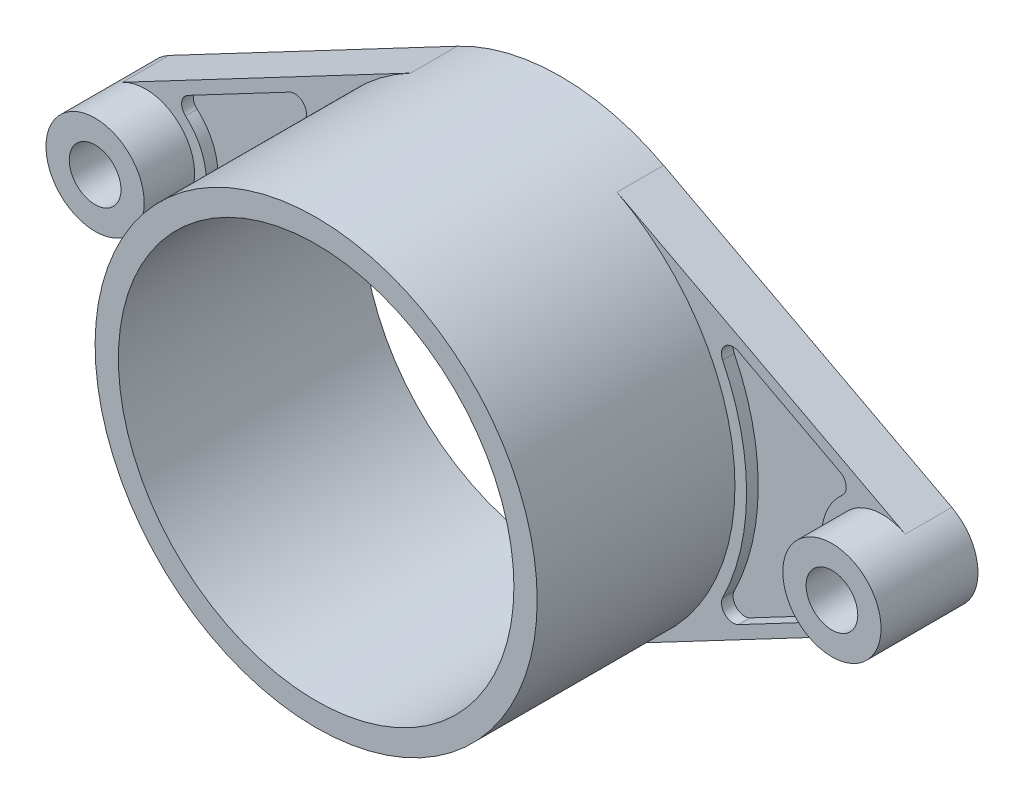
ISO-10303-21;
HEADER;
FILE_DESCRIPTION(('STEP AP214'),'2;1');
FILE_NAME('part.step','',(''),(''),'','','');
FILE_SCHEMA(('AUTOMOTIVE_DESIGN { 1 0 10303 214 1 1 1 1 }'));
ENDSEC;
DATA;
#1=APPLICATION_CONTEXT('core data for automotive mechanical design processes');
#2=APPLICATION_PROTOCOL_DEFINITION('international standard','automotive_design',2000,#1);
#3=PRODUCT_CONTEXT('',#1,'mechanical');
#4=PRODUCT('Part','Part','',(#3));
#5=PRODUCT_RELATED_PRODUCT_CATEGORY('part','',(#4));
#6=PRODUCT_DEFINITION_FORMATION('','',#4);
#7=PRODUCT_DEFINITION_CONTEXT('part definition',#1,'design');
#8=PRODUCT_DEFINITION('design','',#6,#7);
#9=PRODUCT_DEFINITION_SHAPE('','',#8);
#10=(LENGTH_UNIT() NAMED_UNIT(*) SI_UNIT(.MILLI.,.METRE.));
#11=(NAMED_UNIT(*) PLANE_ANGLE_UNIT() SI_UNIT($,.RADIAN.));
#12=(NAMED_UNIT(*) SI_UNIT($,.STERADIAN.) SOLID_ANGLE_UNIT());
#13=UNCERTAINTY_MEASURE_WITH_UNIT(LENGTH_MEASURE(1.E-05),#10,'distance_accuracy_value','');
#14=(GEOMETRIC_REPRESENTATION_CONTEXT(3) GLOBAL_UNCERTAINTY_ASSIGNED_CONTEXT((#13)) GLOBAL_UNIT_ASSIGNED_CONTEXT((#10,
#11,#12)) REPRESENTATION_CONTEXT('',''));
#15=CARTESIAN_POINT('',(0.,0.,0.));
#16=DIRECTION('',(0.,0.,1.));
#17=DIRECTION('',(1.,0.,0.));
#18=AXIS2_PLACEMENT_3D('',#15,#16,#17);
#19=CARTESIAN_POINT('',(95.,0.,6.));
#20=DIRECTION('',(0.,0.,1.));
#21=DIRECTION('',(1.,0.,0.));
#22=AXIS2_PLACEMENT_3D('',#19,#20,#21);
#23=PLANE('',#22);
#24=DIRECTION('',(-0.884433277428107,0.466666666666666,0.));
#25=VECTOR('',#24,1.);
#26=CARTESIAN_POINT('',(26.6,50.4126968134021,6.));
#27=LINE('',#26,#25);
#28=CARTESIAN_POINT('',(100.911111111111,11.2028215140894,6.));
#29=VERTEX_POINT('',#28);
#30=CARTESIAN_POINT('',(26.6,50.4126968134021,6.));
#31=VERTEX_POINT('',#30);
#32=EDGE_CURVE('E433',#29,#31,#27,.T.);
#33=ORIENTED_EDGE('',*,*,#32,.T.);
#34=CARTESIAN_POINT('',(0.,0.,6.));
#35=DIRECTION('',(0.,0.,1.));
#36=DIRECTION('',(1.,0.,0.));
#37=AXIS2_PLACEMENT_3D('',#34,#35,#36);
#38=CIRCLE('',#37,57.);
#39=CARTESIAN_POINT('',(26.6,-50.4126968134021,6.));
#40=VERTEX_POINT('',#39);
#41=EDGE_CURVE('E387',#40,#31,#38,.T.);
#42=ORIENTED_EDGE('',*,*,#41,.F.);
#43=DIRECTION('',(0.884433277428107,0.466666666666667,0.));
#44=VECTOR('',#43,1.);
#45=CARTESIAN_POINT('',(26.6,-50.4126968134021,6.));
#46=LINE('',#45,#44);
#47=CARTESIAN_POINT('',(100.911111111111,-11.2028215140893,6.));
#48=VERTEX_POINT('',#47);
#49=EDGE_CURVE('E443',#40,#48,#46,.T.);
#50=ORIENTED_EDGE('',*,*,#49,.T.);
#51=CARTESIAN_POINT('',(95.,0.,6.));
#52=DIRECTION('',(0.,0.,1.));
#53=DIRECTION('',(1.,0.,0.));
#54=AXIS2_PLACEMENT_3D('',#51,#52,#53);
#55=CIRCLE('',#54,12.6666666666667);
#56=EDGE_CURVE('E412',#29,#48,#55,.T.);
#57=ORIENTED_EDGE('',*,*,#56,.F.);
#58=EDGE_LOOP('',(#33,#42,#50,#57));
#59=FACE_BOUND('',#58,.T.);
#60=DIRECTION('',(-0.884433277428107,0.466666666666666,0.));
#61=VECTOR('',#60,1.);
#62=CARTESIAN_POINT('',(84.0904899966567,16.686133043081,6.));
#63=LINE('',#62,#61);
#64=CARTESIAN_POINT('',(84.0904899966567,16.686133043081,6.));
#65=VERTEX_POINT('',#64);
#66=CARTESIAN_POINT('',(57.9120772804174,30.4990377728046,6.));
#67=VERTEX_POINT('',#66);
#68=EDGE_CURVE('E69',#65,#67,#63,.T.);
#69=ORIENTED_EDGE('',*,*,#68,.F.);
#70=CARTESIAN_POINT('',(82.6904899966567,14.0328332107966,6.));
#71=DIRECTION('',(0.,0.,1.));
#72=DIRECTION('',(1.,0.,0.));
#73=AXIS2_PLACEMENT_3D('',#70,#71,#72);
#74=CIRCLE('',#73,3.00000000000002);
#75=CARTESIAN_POINT('',(84.6688041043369,11.7775564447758,6.));
#76=VERTEX_POINT('',#75);
#77=EDGE_CURVE('E326',#76,#65,#74,.T.);
#78=ORIENTED_EDGE('',*,*,#77,.F.);
#79=CARTESIAN_POINT('',(95.,0.,6.));
#80=DIRECTION('',(0.,0.,1.));
#81=DIRECTION('',(1.,0.,0.));
#82=AXIS2_PLACEMENT_3D('',#79,#80,#81);
#83=CIRCLE('',#82,15.6666666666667);
#84=CARTESIAN_POINT('',(84.6688041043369,-11.7775564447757,6.));
#85=VERTEX_POINT('',#84);
#86=EDGE_CURVE('E330',#76,#85,#83,.T.);
#87=ORIENTED_EDGE('',*,*,#86,.T.);
#88=CARTESIAN_POINT('',(82.6904899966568,-14.0328332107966,6.));
#89=DIRECTION('',(0.,0.,1.));
#90=DIRECTION('',(1.,0.,0.));
#91=AXIS2_PLACEMENT_3D('',#88,#89,#90);
#92=CIRCLE('',#91,3.);
#93=CARTESIAN_POINT('',(84.0904899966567,-16.6861330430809,6.));
#94=VERTEX_POINT('',#93);
#95=EDGE_CURVE('E335',#94,#85,#92,.T.);
#96=ORIENTED_EDGE('',*,*,#95,.F.);
#97=DIRECTION('',(0.884433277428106,0.466666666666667,0.));
#98=VECTOR('',#97,1.);
#99=CARTESIAN_POINT('',(57.9120772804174,-30.4990377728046,6.));
#100=LINE('',#99,#98);
#101=CARTESIAN_POINT('',(57.9120772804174,-30.4990377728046,6.));
#102=VERTEX_POINT('',#101);
#103=EDGE_CURVE('E339',#102,#94,#100,.T.);
#104=ORIENTED_EDGE('',*,*,#103,.F.);
#105=CARTESIAN_POINT('',(56.5120772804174,-27.8457379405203,6.));
#106=DIRECTION('',(0.,0.,1.));
#107=DIRECTION('',(1.,0.,0.));
#108=AXIS2_PLACEMENT_3D('',#105,#106,#107);
#109=CIRCLE('',#108,3.);
#110=CARTESIAN_POINT('',(53.8210259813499,-26.5197504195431,6.));
#111=VERTEX_POINT('',#110);
#112=EDGE_CURVE('E343',#111,#102,#109,.T.);
#113=ORIENTED_EDGE('',*,*,#112,.F.);
#114=CARTESIAN_POINT('',(0.,0.,6.));
#115=DIRECTION('',(0.,0.,1.));
#116=DIRECTION('',(1.,0.,0.));
#117=AXIS2_PLACEMENT_3D('',#114,#115,#116);
#118=CIRCLE('',#117,60.);
#119=CARTESIAN_POINT('',(53.8210259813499,26.5197504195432,6.));
#120=VERTEX_POINT('',#119);
#121=EDGE_CURVE('E347',#111,#120,#118,.T.);
#122=ORIENTED_EDGE('',*,*,#121,.T.);
#123=CARTESIAN_POINT('',(56.5120772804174,27.8457379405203,6.));
#124=DIRECTION('',(0.,0.,-1.));
#125=DIRECTION('',(-1.,0.,0.));
#126=AXIS2_PLACEMENT_3D('',#123,#124,#125);
#127=CIRCLE('',#126,2.99999999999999);
#128=EDGE_CURVE('E351',#120,#67,#127,.T.);
#129=ORIENTED_EDGE('',*,*,#128,.T.);
#130=EDGE_LOOP('',(#69,#78,#87,#96,#104,#113,#122,#129));
#131=FACE_BOUND('',#130,.T.);
#132=ADVANCED_FACE('F45',(#59,#131),#23,.T.);
#133=CARTESIAN_POINT('',(-82.6904899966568,-14.0328332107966,6.));
#134=DIRECTION('',(0.,0.,1.));
#135=DIRECTION('',(1.,0.,0.));
#136=AXIS2_PLACEMENT_3D('',#133,#134,#135);
#137=CIRCLE('',#136,2.99999999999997);
#138=CARTESIAN_POINT('',(-84.6688041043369,-11.7775564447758,6.));
#139=VERTEX_POINT('',#138);
#140=CARTESIAN_POINT('',(-84.0904899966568,-16.6861330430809,6.));
#141=VERTEX_POINT('',#140);
#142=EDGE_CURVE('E61',#139,#141,#137,.T.);
#143=ORIENTED_EDGE('',*,*,#142,.F.);
#144=CARTESIAN_POINT('',(-95.,0.,6.));
#145=DIRECTION('',(0.,0.,1.));
#146=DIRECTION('',(1.,0.,0.));
#147=AXIS2_PLACEMENT_3D('',#144,#145,#146);
#148=CIRCLE('',#147,15.6666666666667);
#149=CARTESIAN_POINT('',(-84.6688041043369,11.7775564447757,6.));
#150=VERTEX_POINT('',#149);
#151=EDGE_CURVE('E231',#139,#150,#148,.T.);
#152=ORIENTED_EDGE('',*,*,#151,.T.);
#153=CARTESIAN_POINT('',(-82.6904899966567,14.0328332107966,6.));
#154=DIRECTION('',(0.,0.,1.));
#155=DIRECTION('',(1.,0.,0.));
#156=AXIS2_PLACEMENT_3D('',#153,#154,#155);
#157=CIRCLE('',#156,3.00000000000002);
#158=CARTESIAN_POINT('',(-84.0904899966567,16.686133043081,6.));
#159=VERTEX_POINT('',#158);
#160=EDGE_CURVE('E235',#159,#150,#157,.T.);
#161=ORIENTED_EDGE('',*,*,#160,.F.);
#162=DIRECTION('',(-0.884433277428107,-0.466666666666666,0.));
#163=VECTOR('',#162,1.);
#164=CARTESIAN_POINT('',(-57.9120772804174,30.4990377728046,6.));
#165=LINE('',#164,#163);
#166=CARTESIAN_POINT('',(-57.9120772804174,30.4990377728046,6.));
#167=VERTEX_POINT('',#166);
#168=EDGE_CURVE('E273',#167,#159,#165,.T.);
#169=ORIENTED_EDGE('',*,*,#168,.F.);
#170=CARTESIAN_POINT('',(-56.5120772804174,27.8457379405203,6.));
#171=DIRECTION('',(0.,0.,1.));
#172=DIRECTION('',(1.,0.,0.));
#173=AXIS2_PLACEMENT_3D('',#170,#171,#172);
#174=CIRCLE('',#173,3.);
#175=CARTESIAN_POINT('',(-53.8210259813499,26.5197504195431,6.));
#176=VERTEX_POINT('',#175);
#177=EDGE_CURVE('E269',#176,#167,#174,.T.);
#178=ORIENTED_EDGE('',*,*,#177,.F.);
#179=CARTESIAN_POINT('',(0.,0.,6.));
#180=DIRECTION('',(0.,0.,1.));
#181=DIRECTION('',(1.,0.,0.));
#182=AXIS2_PLACEMENT_3D('',#179,#180,#181);
#183=CIRCLE('',#182,60.);
#184=CARTESIAN_POINT('',(-53.8210259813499,-26.5197504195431,6.));
#185=VERTEX_POINT('',#184);
#186=EDGE_CURVE('E265',#176,#185,#183,.T.);
#187=ORIENTED_EDGE('',*,*,#186,.T.);
#188=CARTESIAN_POINT('',(-56.5120772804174,-27.8457379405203,6.));
#189=DIRECTION('',(0.,0.,1.));
#190=DIRECTION('',(1.,0.,0.));
#191=AXIS2_PLACEMENT_3D('',#188,#189,#190);
#192=CIRCLE('',#191,3.);
#193=CARTESIAN_POINT('',(-57.9120772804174,-30.4990377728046,6.));
#194=VERTEX_POINT('',#193);
#195=EDGE_CURVE('E261',#194,#185,#192,.T.);
#196=ORIENTED_EDGE('',*,*,#195,.F.);
#197=DIRECTION('',(0.884433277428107,-0.466666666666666,0.));
#198=VECTOR('',#197,1.);
#199=CARTESIAN_POINT('',(-84.0904899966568,-16.6861330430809,6.));
#200=LINE('',#199,#198);
#201=EDGE_CURVE('E258',#141,#194,#200,.T.);
#202=ORIENTED_EDGE('',*,*,#201,.F.);
#203=EDGE_LOOP('',(#143,#152,#161,#169,#178,#187,#196,#202));
#204=FACE_BOUND('',#203,.T.);
#205=DIRECTION('',(0.884433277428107,-0.466666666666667,0.));
#206=VECTOR('',#205,1.);
#207=CARTESIAN_POINT('',(-100.911111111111,-11.2028215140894,6.));
#208=LINE('',#207,#206);
#209=CARTESIAN_POINT('',(-100.911111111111,-11.2028215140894,6.));
#210=VERTEX_POINT('',#209);
#211=CARTESIAN_POINT('',(-26.6,-50.4126968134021,6.));
#212=VERTEX_POINT('',#211);
#213=EDGE_CURVE('E440',#210,#212,#208,.T.);
#214=ORIENTED_EDGE('',*,*,#213,.T.);
#215=CARTESIAN_POINT('',(-26.6,50.4126968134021,6.));
#216=VERTEX_POINT('',#215);
#217=EDGE_CURVE('E393',#216,#212,#38,.T.);
#218=ORIENTED_EDGE('',*,*,#217,.F.);
#219=DIRECTION('',(-0.884433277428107,-0.466666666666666,0.));
#220=VECTOR('',#219,1.);
#221=CARTESIAN_POINT('',(-100.911111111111,11.2028215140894,6.));
#222=LINE('',#221,#220);
#223=CARTESIAN_POINT('',(-100.911111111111,11.2028215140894,6.));
#224=VERTEX_POINT('',#223);
#225=EDGE_CURVE('E436',#216,#224,#222,.T.);
#226=ORIENTED_EDGE('',*,*,#225,.T.);
#227=CARTESIAN_POINT('',(-95.,0.,6.));
#228=DIRECTION('',(0.,0.,1.));
#229=DIRECTION('',(1.,0.,0.));
#230=AXIS2_PLACEMENT_3D('',#227,#228,#229);
#231=CIRCLE('',#230,12.6666666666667);
#232=EDGE_CURVE('E397',#210,#224,#231,.T.);
#233=ORIENTED_EDGE('',*,*,#232,.F.);
#234=EDGE_LOOP('',(#214,#218,#226,#233));
#235=FACE_BOUND('',#234,.T.);
#236=ADVANCED_FACE('F521',(#204,#235),#23,.T.);
#237=CARTESIAN_POINT('',(95.,0.,-6.));
#238=DIRECTION('',(0.,0.,1.));
#239=DIRECTION('',(1.,0.,0.));
#240=AXIS2_PLACEMENT_3D('',#237,#238,#239);
#241=PLANE('',#240);
#242=CARTESIAN_POINT('',(95.,0.,-6.));
#243=DIRECTION('',(0.,0.,1.));
#244=DIRECTION('',(1.,0.,0.));
#245=AXIS2_PLACEMENT_3D('',#242,#243,#244);
#246=CIRCLE('',#245,12.6666666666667);
#247=CARTESIAN_POINT('',(100.911111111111,-11.2028215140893,-6.));
#248=VERTEX_POINT('',#247);
#249=CARTESIAN_POINT('',(100.911111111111,11.2028215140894,-6.));
#250=VERTEX_POINT('',#249);
#251=EDGE_CURVE('E432',#248,#250,#246,.T.);
#252=ORIENTED_EDGE('',*,*,#251,.F.);
#253=DIRECTION('',(0.884433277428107,0.466666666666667,0.));
#254=VECTOR('',#253,1.);
#255=CARTESIAN_POINT('',(26.6,-50.4126968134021,-6.));
#256=LINE('',#255,#254);
#257=CARTESIAN_POINT('',(26.6,-50.4126968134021,-6.));
#258=VERTEX_POINT('',#257);
#259=EDGE_CURVE('E437',#258,#248,#256,.T.);
#260=ORIENTED_EDGE('',*,*,#259,.F.);
#261=CARTESIAN_POINT('',(0.,0.,-6.));
#262=DIRECTION('',(0.,0.,1.));
#263=DIRECTION('',(1.,0.,0.));
#264=AXIS2_PLACEMENT_3D('',#261,#262,#263);
#265=CIRCLE('',#264,57.);
#266=CARTESIAN_POINT('',(-26.6,-50.4126968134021,-6.));
#267=VERTEX_POINT('',#266);
#268=EDGE_CURVE('E465',#267,#258,#265,.T.);
#269=ORIENTED_EDGE('',*,*,#268,.F.);
#270=DIRECTION('',(0.884433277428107,-0.466666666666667,0.));
#271=VECTOR('',#270,1.);
#272=CARTESIAN_POINT('',(-100.911111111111,-11.2028215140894,-6.));
#273=LINE('',#272,#271);
#274=CARTESIAN_POINT('',(-100.911111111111,-11.2028215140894,-6.));
#275=VERTEX_POINT('',#274);
#276=EDGE_CURVE('E462',#275,#267,#273,.T.);
#277=ORIENTED_EDGE('',*,*,#276,.F.);
#278=CARTESIAN_POINT('',(-95.,0.,-6.));
#279=DIRECTION('',(0.,0.,1.));
#280=DIRECTION('',(1.,0.,0.));
#281=AXIS2_PLACEMENT_3D('',#278,#279,#280);
#282=CIRCLE('',#281,12.6666666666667);
#283=CARTESIAN_POINT('',(-100.911111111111,11.2028215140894,-6.));
#284=VERTEX_POINT('',#283);
#285=EDGE_CURVE('E459',#284,#275,#282,.T.);
#286=ORIENTED_EDGE('',*,*,#285,.F.);
#287=DIRECTION('',(-0.884433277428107,-0.466666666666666,0.));
#288=VECTOR('',#287,1.);
#289=CARTESIAN_POINT('',(-100.911111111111,11.2028215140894,-6.));
#290=LINE('',#289,#288);
#291=CARTESIAN_POINT('',(-26.6,50.4126968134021,-6.));
#292=VERTEX_POINT('',#291);
#293=EDGE_CURVE('E456',#292,#284,#290,.T.);
#294=ORIENTED_EDGE('',*,*,#293,.F.);
#295=CARTESIAN_POINT('',(0.,0.,-6.));
#296=DIRECTION('',(0.,0.,1.));
#297=DIRECTION('',(1.,0.,0.));
#298=AXIS2_PLACEMENT_3D('',#295,#296,#297);
#299=CIRCLE('',#298,57.);
#300=CARTESIAN_POINT('',(26.6,50.4126968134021,-6.));
#301=VERTEX_POINT('',#300);
#302=EDGE_CURVE('E453',#301,#292,#299,.T.);
#303=ORIENTED_EDGE('',*,*,#302,.F.);
#304=DIRECTION('',(-0.884433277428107,0.466666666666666,0.));
#305=VECTOR('',#304,1.);
#306=CARTESIAN_POINT('',(26.6,50.4126968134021,-6.));
#307=LINE('',#306,#305);
#308=EDGE_CURVE('E450',#250,#301,#307,.T.);
#309=ORIENTED_EDGE('',*,*,#308,.F.);
#310=EDGE_LOOP('',(#252,#260,#269,#277,#286,#294,#303,#309));
#311=FACE_BOUND('',#310,.T.);
#312=CARTESIAN_POINT('',(-95.,0.,-6.));
#313=DIRECTION('',(0.,0.,1.));
#314=DIRECTION('',(1.,0.,0.));
#315=AXIS2_PLACEMENT_3D('',#312,#313,#314);
#316=CIRCLE('',#315,6.66666666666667);
#317=CARTESIAN_POINT('',(-88.3333333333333,0.,-6.));
#318=VERTEX_POINT('',#317);
#319=EDGE_CURVE('E428',#318,#318,#316,.T.);
#320=ORIENTED_EDGE('',*,*,#319,.T.);
#321=EDGE_LOOP('',(#320));
#322=FACE_BOUND('',#321,.T.);
#323=CARTESIAN_POINT('',(95.,0.,-6.));
#324=DIRECTION('',(0.,0.,1.));
#325=DIRECTION('',(1.,0.,0.));
#326=AXIS2_PLACEMENT_3D('',#323,#324,#325);
#327=CIRCLE('',#326,6.66666666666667);
#328=CARTESIAN_POINT('',(101.666666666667,0.,-6.));
#329=VERTEX_POINT('',#328);
#330=EDGE_CURVE('E424',#329,#329,#327,.T.);
#331=ORIENTED_EDGE('',*,*,#330,.T.);
#332=EDGE_LOOP('',(#331));
#333=FACE_BOUND('',#332,.T.);
#334=CARTESIAN_POINT('',(0.,0.,-6.));
#335=DIRECTION('',(0.,0.,1.));
#336=DIRECTION('',(1.,0.,0.));
#337=AXIS2_PLACEMENT_3D('',#334,#335,#336);
#338=CIRCLE('',#337,51.);
#339=CARTESIAN_POINT('',(51.,0.,-6.));
#340=VERTEX_POINT('',#339);
#341=EDGE_CURVE('E417',#340,#340,#338,.T.);
#342=ORIENTED_EDGE('',*,*,#341,.T.);
#343=EDGE_LOOP('',(#342));
#344=FACE_BOUND('',#343,.T.);
#345=ADVANCED_FACE('F507',(#311,#322,#333,#344),#241,.F.);
#346=CARTESIAN_POINT('',(95.,0.,6.));
#347=DIRECTION('',(0.,0.,-1.));
#348=DIRECTION('',(-1.,0.,0.));
#349=AXIS2_PLACEMENT_3D('',#346,#347,#348);
#350=CYLINDRICAL_SURFACE('',#349,12.6666666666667);
#351=ORIENTED_EDGE('',*,*,#251,.T.);
#352=DIRECTION('',(0.,0.,-1.));
#353=VECTOR('',#352,1.);
#354=CARTESIAN_POINT('',(100.911111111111,11.2028215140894,6.));
#355=LINE('',#354,#353);
#356=EDGE_CURVE('E11',#29,#250,#355,.T.);
#357=ORIENTED_EDGE('',*,*,#356,.F.);
#358=ORIENTED_EDGE('',*,*,#56,.T.);
#359=DIRECTION('',(0.,0.,-1.));
#360=VECTOR('',#359,1.);
#361=CARTESIAN_POINT('',(100.911111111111,-11.2028215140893,6.));
#362=LINE('',#361,#360);
#363=EDGE_CURVE('E446',#48,#248,#362,.T.);
#364=ORIENTED_EDGE('',*,*,#363,.T.);
#365=EDGE_LOOP('',(#351,#357,#358,#364));
#366=FACE_BOUND('',#365,.T.);
#367=CARTESIAN_POINT('',(95.,0.,19.));
#368=DIRECTION('',(0.,0.,1.));
#369=DIRECTION('',(1.,0.,0.));
#370=AXIS2_PLACEMENT_3D('',#367,#368,#369);
#371=CIRCLE('',#370,12.6666666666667);
#372=CARTESIAN_POINT('',(107.666666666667,0.,19.));
#373=VERTEX_POINT('',#372);
#374=EDGE_CURVE('E413',#373,#373,#371,.T.);
#375=ORIENTED_EDGE('',*,*,#374,.F.);
#376=EDGE_LOOP('',(#375));
#377=FACE_BOUND('',#376,.T.);
#378=ADVANCED_FACE('F47',(#366,#377),#350,.T.);
#379=CARTESIAN_POINT('',(26.6,50.4126968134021,6.));
#380=DIRECTION('',(-0.466666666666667,-0.884433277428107,0.));
#381=DIRECTION('',(0.884433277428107,-0.466666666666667,0.));
#382=AXIS2_PLACEMENT_3D('',#379,#380,#381);
#383=PLANE('',#382);
#384=ORIENTED_EDGE('',*,*,#308,.T.);
#385=DIRECTION('',(0.,0.,-1.));
#386=VECTOR('',#385,1.);
#387=CARTESIAN_POINT('',(26.6,50.4126968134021,6.));
#388=LINE('',#387,#386);
#389=EDGE_CURVE('E54',#31,#301,#388,.T.);
#390=ORIENTED_EDGE('',*,*,#389,.F.);
#391=ORIENTED_EDGE('',*,*,#32,.F.);
#392=ORIENTED_EDGE('',*,*,#356,.T.);
#393=EDGE_LOOP('',(#384,#390,#391,#392));
#394=FACE_BOUND('',#393,.T.);
#395=ADVANCED_FACE('F536',(#394),#383,.F.);
#396=CARTESIAN_POINT('',(-100.911111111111,11.2028215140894,6.));
#397=DIRECTION('',(0.466666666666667,-0.884433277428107,0.));
#398=DIRECTION('',(0.884433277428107,0.466666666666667,0.));
#399=AXIS2_PLACEMENT_3D('',#396,#397,#398);
#400=PLANE('',#399);
#401=ORIENTED_EDGE('',*,*,#293,.T.);
#402=DIRECTION('',(0.,0.,-1.));
#403=VECTOR('',#402,1.);
#404=CARTESIAN_POINT('',(-100.911111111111,11.2028215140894,6.));
#405=LINE('',#404,#403);
#406=EDGE_CURVE('E485',#224,#284,#405,.T.);
#407=ORIENTED_EDGE('',*,*,#406,.F.);
#408=ORIENTED_EDGE('',*,*,#225,.F.);
#409=DIRECTION('',(0.,0.,-1.));
#410=VECTOR('',#409,1.);
#411=CARTESIAN_POINT('',(-26.6,50.4126968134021,6.));
#412=LINE('',#411,#410);
#413=EDGE_CURVE('E489',#216,#292,#412,.T.);
#414=ORIENTED_EDGE('',*,*,#413,.T.);
#415=EDGE_LOOP('',(#401,#407,#408,#414));
#416=FACE_BOUND('',#415,.T.);
#417=ADVANCED_FACE('F513',(#416),#400,.F.);
#418=CARTESIAN_POINT('',(-95.,0.,6.));
#419=DIRECTION('',(0.,0.,-1.));
#420=DIRECTION('',(-1.,0.,0.));
#421=AXIS2_PLACEMENT_3D('',#418,#419,#420);
#422=CYLINDRICAL_SURFACE('',#421,12.6666666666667);
#423=ORIENTED_EDGE('',*,*,#285,.T.);
#424=DIRECTION('',(0.,0.,-1.));
#425=VECTOR('',#424,1.);
#426=CARTESIAN_POINT('',(-100.911111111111,-11.2028215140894,6.));
#427=LINE('',#426,#425);
#428=EDGE_CURVE('E481',#210,#275,#427,.T.);
#429=ORIENTED_EDGE('',*,*,#428,.F.);
#430=ORIENTED_EDGE('',*,*,#232,.T.);
#431=ORIENTED_EDGE('',*,*,#406,.T.);
#432=EDGE_LOOP('',(#423,#429,#430,#431));
#433=FACE_BOUND('',#432,.T.);
#434=CARTESIAN_POINT('',(-95.,0.,19.));
#435=DIRECTION('',(0.,0.,1.));
#436=DIRECTION('',(1.,0.,0.));
#437=AXIS2_PLACEMENT_3D('',#434,#435,#436);
#438=CIRCLE('',#437,12.6666666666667);
#439=CARTESIAN_POINT('',(-82.3333333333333,0.,19.));
#440=VERTEX_POINT('',#439);
#441=EDGE_CURVE('E392',#440,#440,#438,.T.);
#442=ORIENTED_EDGE('',*,*,#441,.F.);
#443=EDGE_LOOP('',(#442));
#444=FACE_BOUND('',#443,.T.);
#445=ADVANCED_FACE('F516',(#433,#444),#422,.T.);
#446=CARTESIAN_POINT('',(-100.911111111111,-11.2028215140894,6.));
#447=DIRECTION('',(0.466666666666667,0.884433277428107,0.));
#448=DIRECTION('',(-0.884433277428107,0.466666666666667,0.));
#449=AXIS2_PLACEMENT_3D('',#446,#447,#448);
#450=PLANE('',#449);
#451=ORIENTED_EDGE('',*,*,#276,.T.);
#452=DIRECTION('',(0.,0.,-1.));
#453=VECTOR('',#452,1.);
#454=CARTESIAN_POINT('',(-26.6,-50.4126968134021,6.));
#455=LINE('',#454,#453);
#456=EDGE_CURVE('E477',#212,#267,#455,.T.);
#457=ORIENTED_EDGE('',*,*,#456,.F.);
#458=ORIENTED_EDGE('',*,*,#213,.F.);
#459=ORIENTED_EDGE('',*,*,#428,.T.);
#460=EDGE_LOOP('',(#451,#457,#458,#459));
#461=FACE_BOUND('',#460,.T.);
#462=ADVANCED_FACE('F561',(#461),#450,.F.);
#463=CARTESIAN_POINT('',(0.,0.,6.));
#464=DIRECTION('',(0.,0.,-1.));
#465=DIRECTION('',(-1.,0.,0.));
#466=AXIS2_PLACEMENT_3D('',#463,#464,#465);
#467=CYLINDRICAL_SURFACE('',#466,57.);
#468=ORIENTED_EDGE('',*,*,#268,.T.);
#469=DIRECTION('',(0.,0.,-1.));
#470=VECTOR('',#469,1.);
#471=CARTESIAN_POINT('',(26.6,-50.4126968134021,6.));
#472=LINE('',#471,#470);
#473=EDGE_CURVE('E473',#40,#258,#472,.T.);
#474=ORIENTED_EDGE('',*,*,#473,.F.);
#475=ORIENTED_EDGE('',*,*,#41,.T.);
#476=ORIENTED_EDGE('',*,*,#389,.T.);
#477=ORIENTED_EDGE('',*,*,#302,.T.);
#478=ORIENTED_EDGE('',*,*,#413,.F.);
#479=ORIENTED_EDGE('',*,*,#217,.T.);
#480=ORIENTED_EDGE('',*,*,#456,.T.);
#481=EDGE_LOOP('',(#468,#474,#475,#476,#477,#478,#479,#480));
#482=FACE_BOUND('',#481,.T.);
#483=CARTESIAN_POINT('',(0.,0.,57.));
#484=DIRECTION('',(0.,0.,1.));
#485=DIRECTION('',(1.,0.,0.));
#486=AXIS2_PLACEMENT_3D('',#483,#484,#485);
#487=CIRCLE('',#486,57.);
#488=CARTESIAN_POINT('',(57.,0.,57.));
#489=VERTEX_POINT('',#488);
#490=EDGE_CURVE('E388',#489,#489,#487,.T.);
#491=ORIENTED_EDGE('',*,*,#490,.F.);
#492=EDGE_LOOP('',(#491));
#493=FACE_BOUND('',#492,.T.);
#494=ADVANCED_FACE('F497',(#482,#493),#467,.T.);
#495=CARTESIAN_POINT('',(26.6,-50.4126968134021,6.));
#496=DIRECTION('',(-0.466666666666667,0.884433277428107,0.));
#497=DIRECTION('',(-0.884433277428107,-0.466666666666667,0.));
#498=AXIS2_PLACEMENT_3D('',#495,#496,#497);
#499=PLANE('',#498);
#500=ORIENTED_EDGE('',*,*,#259,.T.);
#501=ORIENTED_EDGE('',*,*,#363,.F.);
#502=ORIENTED_EDGE('',*,*,#49,.F.);
#503=ORIENTED_EDGE('',*,*,#473,.T.);
#504=EDGE_LOOP('',(#500,#501,#502,#503));
#505=FACE_BOUND('',#504,.T.);
#506=ADVANCED_FACE('F530',(#505),#499,.F.);
#507=CARTESIAN_POINT('',(-95.,0.,6.));
#508=DIRECTION('',(0.,0.,-1.));
#509=DIRECTION('',(-1.,0.,0.));
#510=AXIS2_PLACEMENT_3D('',#507,#508,#509);
#511=CYLINDRICAL_SURFACE('',#510,6.66666666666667);
#512=ORIENTED_EDGE('',*,*,#319,.F.);
#513=EDGE_LOOP('',(#512));
#514=FACE_BOUND('',#513,.T.);
#515=CARTESIAN_POINT('',(-95.,0.,19.));
#516=DIRECTION('',(0.,0.,1.));
#517=DIRECTION('',(1.,0.,0.));
#518=AXIS2_PLACEMENT_3D('',#515,#516,#517);
#519=CIRCLE('',#518,6.66666666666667);
#520=CARTESIAN_POINT('',(-88.3333333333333,0.,19.));
#521=VERTEX_POINT('',#520);
#522=EDGE_CURVE('E401',#521,#521,#519,.T.);
#523=ORIENTED_EDGE('',*,*,#522,.T.);
#524=EDGE_LOOP('',(#523));
#525=FACE_BOUND('',#524,.T.);
#526=ADVANCED_FACE('F553',(#514,#525),#511,.F.);
#527=CARTESIAN_POINT('',(95.,0.,6.));
#528=DIRECTION('',(0.,0.,-1.));
#529=DIRECTION('',(-1.,0.,0.));
#530=AXIS2_PLACEMENT_3D('',#527,#528,#529);
#531=CYLINDRICAL_SURFACE('',#530,6.66666666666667);
#532=ORIENTED_EDGE('',*,*,#330,.F.);
#533=EDGE_LOOP('',(#532));
#534=FACE_BOUND('',#533,.T.);
#535=CARTESIAN_POINT('',(95.,0.,19.));
#536=DIRECTION('',(0.,0.,1.));
#537=DIRECTION('',(1.,0.,0.));
#538=AXIS2_PLACEMENT_3D('',#535,#536,#537);
#539=CIRCLE('',#538,6.66666666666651);
#540=CARTESIAN_POINT('',(101.666666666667,0.,19.));
#541=VERTEX_POINT('',#540);
#542=EDGE_CURVE('E408',#541,#541,#539,.T.);
#543=ORIENTED_EDGE('',*,*,#542,.T.);
#544=EDGE_LOOP('',(#543));
#545=FACE_BOUND('',#544,.T.);
#546=ADVANCED_FACE('F583',(#534,#545),#531,.F.);
#547=CARTESIAN_POINT('',(0.,0.,6.));
#548=DIRECTION('',(0.,0.,-1.));
#549=DIRECTION('',(-1.,0.,0.));
#550=AXIS2_PLACEMENT_3D('',#547,#548,#549);
#551=CYLINDRICAL_SURFACE('',#550,51.);
#552=ORIENTED_EDGE('',*,*,#341,.F.);
#553=EDGE_LOOP('',(#552));
#554=FACE_BOUND('',#553,.T.);
#555=CARTESIAN_POINT('',(0.,0.,57.));
#556=DIRECTION('',(0.,0.,1.));
#557=DIRECTION('',(1.,0.,0.));
#558=AXIS2_PLACEMENT_3D('',#555,#556,#557);
#559=CIRCLE('',#558,51.);
#560=CARTESIAN_POINT('',(51.,0.,57.));
#561=VERTEX_POINT('',#560);
#562=EDGE_CURVE('E283',#561,#561,#559,.T.);
#563=ORIENTED_EDGE('',*,*,#562,.T.);
#564=EDGE_LOOP('',(#563));
#565=FACE_BOUND('',#564,.T.);
#566=ADVANCED_FACE('F590',(#554,#565),#551,.F.);
#567=CARTESIAN_POINT('',(95.,0.,19.));
#568=DIRECTION('',(0.,0.,1.));
#569=DIRECTION('',(1.,0.,0.));
#570=AXIS2_PLACEMENT_3D('',#567,#568,#569);
#571=PLANE('',#570);
#572=ORIENTED_EDGE('',*,*,#374,.T.);
#573=EDGE_LOOP('',(#572));
#574=FACE_BOUND('',#573,.T.);
#575=ORIENTED_EDGE('',*,*,#542,.F.);
#576=EDGE_LOOP('',(#575));
#577=FACE_BOUND('',#576,.T.);
#578=ADVANCED_FACE('F596',(#574,#577),#571,.T.);
#579=CARTESIAN_POINT('',(-95.,0.,19.));
#580=DIRECTION('',(0.,0.,1.));
#581=DIRECTION('',(1.,0.,0.));
#582=AXIS2_PLACEMENT_3D('',#579,#580,#581);
#583=PLANE('',#582);
#584=ORIENTED_EDGE('',*,*,#441,.T.);
#585=EDGE_LOOP('',(#584));
#586=FACE_BOUND('',#585,.T.);
#587=ORIENTED_EDGE('',*,*,#522,.F.);
#588=EDGE_LOOP('',(#587));
#589=FACE_BOUND('',#588,.T.);
#590=ADVANCED_FACE('F598',(#586,#589),#583,.T.);
#591=CARTESIAN_POINT('',(0.,0.,57.));
#592=DIRECTION('',(0.,0.,1.));
#593=DIRECTION('',(1.,0.,0.));
#594=AXIS2_PLACEMENT_3D('',#591,#592,#593);
#595=PLANE('',#594);
#596=ORIENTED_EDGE('',*,*,#490,.T.);
#597=EDGE_LOOP('',(#596));
#598=FACE_BOUND('',#597,.T.);
#599=ORIENTED_EDGE('',*,*,#562,.F.);
#600=EDGE_LOOP('',(#599));
#601=FACE_BOUND('',#600,.T.);
#602=ADVANCED_FACE('F606',(#598,#601),#595,.T.);
#603=CARTESIAN_POINT('',(84.0904899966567,16.686133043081,3.));
#604=DIRECTION('',(0.466666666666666,0.884433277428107,0.));
#605=DIRECTION('',(-0.884433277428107,0.466666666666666,0.));
#606=AXIS2_PLACEMENT_3D('',#603,#604,#605);
#607=PLANE('',#606);
#608=ORIENTED_EDGE('',*,*,#68,.T.);
#609=DIRECTION('',(0.,0.,1.));
#610=VECTOR('',#609,1.);
#611=CARTESIAN_POINT('',(57.9120772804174,30.4990377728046,3.));
#612=LINE('',#611,#610);
#613=CARTESIAN_POINT('',(57.9120772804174,30.4990377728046,3.));
#614=VERTEX_POINT('',#613);
#615=EDGE_CURVE('E301',#614,#67,#612,.T.);
#616=ORIENTED_EDGE('',*,*,#615,.F.);
#617=DIRECTION('',(-0.884433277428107,0.466666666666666,0.));
#618=VECTOR('',#617,1.);
#619=CARTESIAN_POINT('',(84.0904899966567,16.686133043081,3.));
#620=LINE('',#619,#618);
#621=CARTESIAN_POINT('',(84.0904899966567,16.686133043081,3.));
#622=VERTEX_POINT('',#621);
#623=EDGE_CURVE('E331',#622,#614,#620,.T.);
#624=ORIENTED_EDGE('',*,*,#623,.F.);
#625=DIRECTION('',(0.,0.,1.));
#626=VECTOR('',#625,1.);
#627=CARTESIAN_POINT('',(84.0904899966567,16.686133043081,3.));
#628=LINE('',#627,#626);
#629=EDGE_CURVE('E323',#622,#65,#628,.T.);
#630=ORIENTED_EDGE('',*,*,#629,.T.);
#631=EDGE_LOOP('',(#608,#616,#624,#630));
#632=FACE_BOUND('',#631,.T.);
#633=ADVANCED_FACE('F647',(#632),#607,.F.);
#634=CARTESIAN_POINT('',(82.6904899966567,14.0328332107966,3.));
#635=DIRECTION('',(0.,0.,1.));
#636=DIRECTION('',(1.,0.,0.));
#637=AXIS2_PLACEMENT_3D('',#634,#635,#636);
#638=CYLINDRICAL_SURFACE('',#637,3.00000000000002);
#639=ORIENTED_EDGE('',*,*,#77,.T.);
#640=ORIENTED_EDGE('',*,*,#629,.F.);
#641=CARTESIAN_POINT('',(82.6904899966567,14.0328332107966,3.));
#642=DIRECTION('',(0.,0.,1.));
#643=DIRECTION('',(1.,0.,0.));
#644=AXIS2_PLACEMENT_3D('',#641,#642,#643);
#645=CIRCLE('',#644,3.00000000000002);
#646=CARTESIAN_POINT('',(84.6688041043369,11.7775564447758,3.));
#647=VERTEX_POINT('',#646);
#648=EDGE_CURVE('E304',#647,#622,#645,.T.);
#649=ORIENTED_EDGE('',*,*,#648,.F.);
#650=DIRECTION('',(0.,0.,1.));
#651=VECTOR('',#650,1.);
#652=CARTESIAN_POINT('',(84.6688041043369,11.7775564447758,3.));
#653=LINE('',#652,#651);
#654=EDGE_CURVE('E320',#647,#76,#653,.T.);
#655=ORIENTED_EDGE('',*,*,#654,.T.);
#656=EDGE_LOOP('',(#639,#640,#649,#655));
#657=FACE_BOUND('',#656,.T.);
#658=ADVANCED_FACE('F660',(#657),#638,.F.);
#659=CARTESIAN_POINT('',(95.,0.,3.));
#660=DIRECTION('',(0.,0.,1.));
#661=DIRECTION('',(1.,0.,0.));
#662=AXIS2_PLACEMENT_3D('',#659,#660,#661);
#663=CYLINDRICAL_SURFACE('',#662,15.6666666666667);
#664=ORIENTED_EDGE('',*,*,#86,.F.);
#665=ORIENTED_EDGE('',*,*,#654,.F.);
#666=CARTESIAN_POINT('',(95.,0.,3.));
#667=DIRECTION('',(0.,0.,1.));
#668=DIRECTION('',(1.,0.,0.));
#669=AXIS2_PLACEMENT_3D('',#666,#667,#668);
#670=CIRCLE('',#669,15.6666666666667);
#671=CARTESIAN_POINT('',(84.6688041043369,-11.7775564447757,3.));
#672=VERTEX_POINT('',#671);
#673=EDGE_CURVE('E360',#647,#672,#670,.T.);
#674=ORIENTED_EDGE('',*,*,#673,.T.);
#675=DIRECTION('',(0.,0.,1.));
#676=VECTOR('',#675,1.);
#677=CARTESIAN_POINT('',(84.6688041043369,-11.7775564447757,3.));
#678=LINE('',#677,#676);
#679=EDGE_CURVE('E317',#672,#85,#678,.T.);
#680=ORIENTED_EDGE('',*,*,#679,.T.);
#681=EDGE_LOOP('',(#664,#665,#674,#680));
#682=FACE_BOUND('',#681,.T.);
#683=ADVANCED_FACE('F669',(#682),#663,.T.);
#684=CARTESIAN_POINT('',(82.6904899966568,-14.0328332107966,3.));
#685=DIRECTION('',(0.,0.,1.));
#686=DIRECTION('',(1.,0.,0.));
#687=AXIS2_PLACEMENT_3D('',#684,#685,#686);
#688=CYLINDRICAL_SURFACE('',#687,3.);
#689=ORIENTED_EDGE('',*,*,#95,.T.);
#690=ORIENTED_EDGE('',*,*,#679,.F.);
#691=CARTESIAN_POINT('',(82.6904899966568,-14.0328332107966,3.));
#692=DIRECTION('',(0.,0.,1.));
#693=DIRECTION('',(1.,0.,0.));
#694=AXIS2_PLACEMENT_3D('',#691,#692,#693);
#695=CIRCLE('',#694,3.);
#696=CARTESIAN_POINT('',(84.0904899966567,-16.6861330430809,3.));
#697=VERTEX_POINT('',#696);
#698=EDGE_CURVE('E363',#697,#672,#695,.T.);
#699=ORIENTED_EDGE('',*,*,#698,.F.);
#700=DIRECTION('',(0.,0.,1.));
#701=VECTOR('',#700,1.);
#702=CARTESIAN_POINT('',(84.0904899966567,-16.6861330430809,3.));
#703=LINE('',#702,#701);
#704=EDGE_CURVE('E314',#697,#94,#703,.T.);
#705=ORIENTED_EDGE('',*,*,#704,.T.);
#706=EDGE_LOOP('',(#689,#690,#699,#705));
#707=FACE_BOUND('',#706,.T.);
#708=ADVANCED_FACE('F679',(#707),#688,.F.);
#709=CARTESIAN_POINT('',(57.9120772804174,-30.4990377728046,3.));
#710=DIRECTION('',(0.466666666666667,-0.884433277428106,0.));
#711=DIRECTION('',(0.884433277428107,0.466666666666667,0.));
#712=AXIS2_PLACEMENT_3D('',#709,#710,#711);
#713=PLANE('',#712);
#714=ORIENTED_EDGE('',*,*,#103,.T.);
#715=ORIENTED_EDGE('',*,*,#704,.F.);
#716=DIRECTION('',(0.884433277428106,0.466666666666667,0.));
#717=VECTOR('',#716,1.);
#718=CARTESIAN_POINT('',(57.9120772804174,-30.4990377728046,3.));
#719=LINE('',#718,#717);
#720=CARTESIAN_POINT('',(57.9120772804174,-30.4990377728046,3.));
#721=VERTEX_POINT('',#720);
#722=EDGE_CURVE('E367',#721,#697,#719,.T.);
#723=ORIENTED_EDGE('',*,*,#722,.F.);
#724=DIRECTION('',(0.,0.,1.));
#725=VECTOR('',#724,1.);
#726=CARTESIAN_POINT('',(57.9120772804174,-30.4990377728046,3.));
#727=LINE('',#726,#725);
#728=EDGE_CURVE('E311',#721,#102,#727,.T.);
#729=ORIENTED_EDGE('',*,*,#728,.T.);
#730=EDGE_LOOP('',(#714,#715,#723,#729));
#731=FACE_BOUND('',#730,.T.);
#732=ADVANCED_FACE('F689',(#731),#713,.F.);
#733=CARTESIAN_POINT('',(56.5120772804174,-27.8457379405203,3.));
#734=DIRECTION('',(0.,0.,1.));
#735=DIRECTION('',(1.,0.,0.));
#736=AXIS2_PLACEMENT_3D('',#733,#734,#735);
#737=CYLINDRICAL_SURFACE('',#736,3.);
#738=ORIENTED_EDGE('',*,*,#112,.T.);
#739=ORIENTED_EDGE('',*,*,#728,.F.);
#740=CARTESIAN_POINT('',(56.5120772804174,-27.8457379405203,3.));
#741=DIRECTION('',(0.,0.,1.));
#742=DIRECTION('',(1.,0.,0.));
#743=AXIS2_PLACEMENT_3D('',#740,#741,#742);
#744=CIRCLE('',#743,3.);
#745=CARTESIAN_POINT('',(53.8210259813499,-26.5197504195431,3.));
#746=VERTEX_POINT('',#745);
#747=EDGE_CURVE('E371',#746,#721,#744,.T.);
#748=ORIENTED_EDGE('',*,*,#747,.F.);
#749=DIRECTION('',(0.,0.,1.));
#750=VECTOR('',#749,1.);
#751=CARTESIAN_POINT('',(53.8210259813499,-26.5197504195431,3.));
#752=LINE('',#751,#750);
#753=EDGE_CURVE('E308',#746,#111,#752,.T.);
#754=ORIENTED_EDGE('',*,*,#753,.T.);
#755=EDGE_LOOP('',(#738,#739,#748,#754));
#756=FACE_BOUND('',#755,.T.);
#757=ADVANCED_FACE('F699',(#756),#737,.F.);
#758=CARTESIAN_POINT('',(0.,0.,3.));
#759=DIRECTION('',(0.,0.,1.));
#760=DIRECTION('',(1.,0.,0.));
#761=AXIS2_PLACEMENT_3D('',#758,#759,#760);
#762=CYLINDRICAL_SURFACE('',#761,60.);
#763=ORIENTED_EDGE('',*,*,#121,.F.);
#764=ORIENTED_EDGE('',*,*,#753,.F.);
#765=CARTESIAN_POINT('',(0.,0.,3.));
#766=DIRECTION('',(0.,0.,1.));
#767=DIRECTION('',(1.,0.,0.));
#768=AXIS2_PLACEMENT_3D('',#765,#766,#767);
#769=CIRCLE('',#768,60.);
#770=CARTESIAN_POINT('',(53.8210259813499,26.5197504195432,3.));
#771=VERTEX_POINT('',#770);
#772=EDGE_CURVE('E375',#746,#771,#769,.T.);
#773=ORIENTED_EDGE('',*,*,#772,.T.);
#774=DIRECTION('',(0.,0.,1.));
#775=VECTOR('',#774,1.);
#776=CARTESIAN_POINT('',(53.8210259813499,26.5197504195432,3.));
#777=LINE('',#776,#775);
#778=EDGE_CURVE('E305',#771,#120,#777,.T.);
#779=ORIENTED_EDGE('',*,*,#778,.T.);
#780=EDGE_LOOP('',(#763,#764,#773,#779));
#781=FACE_BOUND('',#780,.T.);
#782=ADVANCED_FACE('F709',(#781),#762,.T.);
#783=CARTESIAN_POINT('',(56.5120772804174,27.8457379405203,3.));
#784=DIRECTION('',(0.,0.,1.));
#785=DIRECTION('',(1.,0.,0.));
#786=AXIS2_PLACEMENT_3D('',#783,#784,#785);
#787=CYLINDRICAL_SURFACE('',#786,2.99999999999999);
#788=ORIENTED_EDGE('',*,*,#128,.F.);
#789=ORIENTED_EDGE('',*,*,#778,.F.);
#790=CARTESIAN_POINT('',(56.5120772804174,27.8457379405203,3.));
#791=DIRECTION('',(0.,0.,-1.));
#792=DIRECTION('',(-1.,0.,0.));
#793=AXIS2_PLACEMENT_3D('',#790,#791,#792);
#794=CIRCLE('',#793,2.99999999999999);
#795=EDGE_CURVE('E378',#771,#614,#794,.T.);
#796=ORIENTED_EDGE('',*,*,#795,.T.);
#797=ORIENTED_EDGE('',*,*,#615,.T.);
#798=EDGE_LOOP('',(#788,#789,#796,#797));
#799=FACE_BOUND('',#798,.T.);
#800=ADVANCED_FACE('F719',(#799),#787,.F.);
#801=CARTESIAN_POINT('',(56.5120772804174,27.8457379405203,3.));
#802=DIRECTION('',(0.,0.,-1.));
#803=DIRECTION('',(-1.,0.,0.));
#804=AXIS2_PLACEMENT_3D('',#801,#802,#803);
#805=PLANE('',#804);
#806=ORIENTED_EDGE('',*,*,#623,.T.);
#807=ORIENTED_EDGE('',*,*,#795,.F.);
#808=ORIENTED_EDGE('',*,*,#772,.F.);
#809=ORIENTED_EDGE('',*,*,#747,.T.);
#810=ORIENTED_EDGE('',*,*,#722,.T.);
#811=ORIENTED_EDGE('',*,*,#698,.T.);
#812=ORIENTED_EDGE('',*,*,#673,.F.);
#813=ORIENTED_EDGE('',*,*,#648,.T.);
#814=EDGE_LOOP('',(#806,#807,#808,#809,#810,#811,#812,#813));
#815=FACE_BOUND('',#814,.T.);
#816=ADVANCED_FACE('F729',(#815),#805,.F.);
#817=CARTESIAN_POINT('',(-82.6904899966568,-14.0328332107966,3.));
#818=DIRECTION('',(0.,0.,1.));
#819=DIRECTION('',(1.,0.,0.));
#820=AXIS2_PLACEMENT_3D('',#817,#818,#819);
#821=CYLINDRICAL_SURFACE('',#820,2.99999999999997);
#822=ORIENTED_EDGE('',*,*,#142,.T.);
#823=DIRECTION('',(0.,0.,1.));
#824=VECTOR('',#823,1.);
#825=CARTESIAN_POINT('',(-84.0904899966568,-16.6861330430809,3.));
#826=LINE('',#825,#824);
#827=CARTESIAN_POINT('',(-84.0904899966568,-16.6861330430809,3.));
#828=VERTEX_POINT('',#827);
#829=EDGE_CURVE('E206',#828,#141,#826,.T.);
#830=ORIENTED_EDGE('',*,*,#829,.F.);
#831=CARTESIAN_POINT('',(-82.6904899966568,-14.0328332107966,3.));
#832=DIRECTION('',(0.,0.,1.));
#833=DIRECTION('',(1.,0.,0.));
#834=AXIS2_PLACEMENT_3D('',#831,#832,#833);
#835=CIRCLE('',#834,2.99999999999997);
#836=CARTESIAN_POINT('',(-84.6688041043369,-11.7775564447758,3.));
#837=VERTEX_POINT('',#836);
#838=EDGE_CURVE('E210',#837,#828,#835,.T.);
#839=ORIENTED_EDGE('',*,*,#838,.F.);
#840=DIRECTION('',(0.,0.,1.));
#841=VECTOR('',#840,1.);
#842=CARTESIAN_POINT('',(-84.6688041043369,-11.7775564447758,3.));
#843=LINE('',#842,#841);
#844=EDGE_CURVE('E280',#837,#139,#843,.T.);
#845=ORIENTED_EDGE('',*,*,#844,.T.);
#846=EDGE_LOOP('',(#822,#830,#839,#845));
#847=FACE_BOUND('',#846,.T.);
#848=ADVANCED_FACE('F208',(#847),#821,.F.);
#849=CARTESIAN_POINT('',(-95.,0.,3.));
#850=DIRECTION('',(0.,0.,1.));
#851=DIRECTION('',(1.,0.,0.));
#852=AXIS2_PLACEMENT_3D('',#849,#850,#851);
#853=CYLINDRICAL_SURFACE('',#852,15.6666666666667);
#854=ORIENTED_EDGE('',*,*,#151,.F.);
#855=ORIENTED_EDGE('',*,*,#844,.F.);
#856=CARTESIAN_POINT('',(-95.,0.,3.));
#857=DIRECTION('',(0.,0.,1.));
#858=DIRECTION('',(1.,0.,0.));
#859=AXIS2_PLACEMENT_3D('',#856,#857,#858);
#860=CIRCLE('',#859,15.6666666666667);
#861=CARTESIAN_POINT('',(-84.6688041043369,11.7775564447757,3.));
#862=VERTEX_POINT('',#861);
#863=EDGE_CURVE('E216',#837,#862,#860,.T.);
#864=ORIENTED_EDGE('',*,*,#863,.T.);
#865=DIRECTION('',(0.,0.,1.));
#866=VECTOR('',#865,1.);
#867=CARTESIAN_POINT('',(-84.6688041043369,11.7775564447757,3.));
#868=LINE('',#867,#866);
#869=EDGE_CURVE('E284',#862,#150,#868,.T.);
#870=ORIENTED_EDGE('',*,*,#869,.T.);
#871=EDGE_LOOP('',(#854,#855,#864,#870));
#872=FACE_BOUND('',#871,.T.);
#873=ADVANCED_FACE('F748',(#872),#853,.T.);
#874=CARTESIAN_POINT('',(-82.6904899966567,14.0328332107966,3.));
#875=DIRECTION('',(0.,0.,1.));
#876=DIRECTION('',(1.,0.,0.));
#877=AXIS2_PLACEMENT_3D('',#874,#875,#876);
#878=CYLINDRICAL_SURFACE('',#877,3.00000000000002);
#879=ORIENTED_EDGE('',*,*,#160,.T.);
#880=ORIENTED_EDGE('',*,*,#869,.F.);
#881=CARTESIAN_POINT('',(-82.6904899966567,14.0328332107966,3.));
#882=DIRECTION('',(0.,0.,1.));
#883=DIRECTION('',(1.,0.,0.));
#884=AXIS2_PLACEMENT_3D('',#881,#882,#883);
#885=CIRCLE('',#884,3.00000000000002);
#886=CARTESIAN_POINT('',(-84.0904899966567,16.686133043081,3.));
#887=VERTEX_POINT('',#886);
#888=EDGE_CURVE('E251',#887,#862,#885,.T.);
#889=ORIENTED_EDGE('',*,*,#888,.F.);
#890=DIRECTION('',(0.,0.,1.));
#891=VECTOR('',#890,1.);
#892=CARTESIAN_POINT('',(-84.0904899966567,16.686133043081,3.));
#893=LINE('',#892,#891);
#894=EDGE_CURVE('E287',#887,#159,#893,.T.);
#895=ORIENTED_EDGE('',*,*,#894,.T.);
#896=EDGE_LOOP('',(#879,#880,#889,#895));
#897=FACE_BOUND('',#896,.T.);
#898=ADVANCED_FACE('F757',(#897),#878,.F.);
#899=CARTESIAN_POINT('',(-57.9120772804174,30.4990377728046,3.));
#900=DIRECTION('',(-0.466666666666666,0.884433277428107,0.));
#901=DIRECTION('',(-0.884433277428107,-0.466666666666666,0.));
#902=AXIS2_PLACEMENT_3D('',#899,#900,#901);
#903=PLANE('',#902);
#904=ORIENTED_EDGE('',*,*,#168,.T.);
#905=ORIENTED_EDGE('',*,*,#894,.F.);
#906=DIRECTION('',(-0.884433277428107,-0.466666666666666,0.));
#907=VECTOR('',#906,1.);
#908=CARTESIAN_POINT('',(-57.9120772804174,30.4990377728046,3.));
#909=LINE('',#908,#907);
#910=CARTESIAN_POINT('',(-57.9120772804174,30.4990377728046,3.));
#911=VERTEX_POINT('',#910);
#912=EDGE_CURVE('E247',#911,#887,#909,.T.);
#913=ORIENTED_EDGE('',*,*,#912,.F.);
#914=DIRECTION('',(0.,0.,1.));
#915=VECTOR('',#914,1.);
#916=CARTESIAN_POINT('',(-57.9120772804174,30.4990377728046,3.));
#917=LINE('',#916,#915);
#918=EDGE_CURVE('E290',#911,#167,#917,.T.);
#919=ORIENTED_EDGE('',*,*,#918,.T.);
#920=EDGE_LOOP('',(#904,#905,#913,#919));
#921=FACE_BOUND('',#920,.T.);
#922=ADVANCED_FACE('F767',(#921),#903,.F.);
#923=CARTESIAN_POINT('',(-56.5120772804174,27.8457379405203,3.));
#924=DIRECTION('',(0.,0.,1.));
#925=DIRECTION('',(1.,0.,0.));
#926=AXIS2_PLACEMENT_3D('',#923,#924,#925);
#927=CYLINDRICAL_SURFACE('',#926,3.);
#928=ORIENTED_EDGE('',*,*,#177,.T.);
#929=ORIENTED_EDGE('',*,*,#918,.F.);
#930=CARTESIAN_POINT('',(-56.5120772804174,27.8457379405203,3.));
#931=DIRECTION('',(0.,0.,1.));
#932=DIRECTION('',(1.,0.,0.));
#933=AXIS2_PLACEMENT_3D('',#930,#931,#932);
#934=CIRCLE('',#933,3.);
#935=CARTESIAN_POINT('',(-53.8210259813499,26.5197504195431,3.));
#936=VERTEX_POINT('',#935);
#937=EDGE_CURVE('E243',#936,#911,#934,.T.);
#938=ORIENTED_EDGE('',*,*,#937,.F.);
#939=DIRECTION('',(0.,0.,1.));
#940=VECTOR('',#939,1.);
#941=CARTESIAN_POINT('',(-53.8210259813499,26.5197504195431,3.));
#942=LINE('',#941,#940);
#943=EDGE_CURVE('E293',#936,#176,#942,.T.);
#944=ORIENTED_EDGE('',*,*,#943,.T.);
#945=EDGE_LOOP('',(#928,#929,#938,#944));
#946=FACE_BOUND('',#945,.T.);
#947=ADVANCED_FACE('F777',(#946),#927,.F.);
#948=CARTESIAN_POINT('',(0.,0.,3.));
#949=DIRECTION('',(0.,0.,1.));
#950=DIRECTION('',(1.,0.,0.));
#951=AXIS2_PLACEMENT_3D('',#948,#949,#950);
#952=CYLINDRICAL_SURFACE('',#951,60.);
#953=ORIENTED_EDGE('',*,*,#186,.F.);
#954=ORIENTED_EDGE('',*,*,#943,.F.);
#955=CARTESIAN_POINT('',(0.,0.,3.));
#956=DIRECTION('',(0.,0.,1.));
#957=DIRECTION('',(1.,0.,0.));
#958=AXIS2_PLACEMENT_3D('',#955,#956,#957);
#959=CIRCLE('',#958,60.);
#960=CARTESIAN_POINT('',(-53.8210259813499,-26.5197504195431,3.));
#961=VERTEX_POINT('',#960);
#962=EDGE_CURVE('E240',#936,#961,#959,.T.);
#963=ORIENTED_EDGE('',*,*,#962,.T.);
#964=DIRECTION('',(0.,0.,1.));
#965=VECTOR('',#964,1.);
#966=CARTESIAN_POINT('',(-53.8210259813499,-26.5197504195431,3.));
#967=LINE('',#966,#965);
#968=EDGE_CURVE('E296',#961,#185,#967,.T.);
#969=ORIENTED_EDGE('',*,*,#968,.T.);
#970=EDGE_LOOP('',(#953,#954,#963,#969));
#971=FACE_BOUND('',#970,.T.);
#972=ADVANCED_FACE('F787',(#971),#952,.T.);
#973=CARTESIAN_POINT('',(-56.5120772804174,-27.8457379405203,3.));
#974=DIRECTION('',(0.,0.,1.));
#975=DIRECTION('',(1.,0.,0.));
#976=AXIS2_PLACEMENT_3D('',#973,#974,#975);
#977=CYLINDRICAL_SURFACE('',#976,3.);
#978=ORIENTED_EDGE('',*,*,#195,.T.);
#979=ORIENTED_EDGE('',*,*,#968,.F.);
#980=CARTESIAN_POINT('',(-56.5120772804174,-27.8457379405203,3.));
#981=DIRECTION('',(0.,0.,1.));
#982=DIRECTION('',(1.,0.,0.));
#983=AXIS2_PLACEMENT_3D('',#980,#981,#982);
#984=CIRCLE('',#983,3.);
#985=CARTESIAN_POINT('',(-57.9120772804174,-30.4990377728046,3.));
#986=VERTEX_POINT('',#985);
#987=EDGE_CURVE('E225',#986,#961,#984,.T.);
#988=ORIENTED_EDGE('',*,*,#987,.F.);
#989=DIRECTION('',(0.,0.,1.));
#990=VECTOR('',#989,1.);
#991=CARTESIAN_POINT('',(-57.9120772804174,-30.4990377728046,3.));
#992=LINE('',#991,#990);
#993=EDGE_CURVE('E215',#986,#194,#992,.T.);
#994=ORIENTED_EDGE('',*,*,#993,.T.);
#995=EDGE_LOOP('',(#978,#979,#988,#994));
#996=FACE_BOUND('',#995,.T.);
#997=ADVANCED_FACE('F797',(#996),#977,.F.);
#998=CARTESIAN_POINT('',(-84.0904899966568,-16.6861330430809,3.));
#999=DIRECTION('',(-0.466666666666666,-0.884433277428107,0.));
#1000=DIRECTION('',(0.884433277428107,-0.466666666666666,0.));
#1001=AXIS2_PLACEMENT_3D('',#998,#999,#1000);
#1002=PLANE('',#1001);
#1003=ORIENTED_EDGE('',*,*,#201,.T.);
#1004=ORIENTED_EDGE('',*,*,#993,.F.);
#1005=DIRECTION('',(0.884433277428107,-0.466666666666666,0.));
#1006=VECTOR('',#1005,1.);
#1007=CARTESIAN_POINT('',(-84.0904899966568,-16.6861330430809,3.));
#1008=LINE('',#1007,#1006);
#1009=EDGE_CURVE('E219',#828,#986,#1008,.T.);
#1010=ORIENTED_EDGE('',*,*,#1009,.F.);
#1011=ORIENTED_EDGE('',*,*,#829,.T.);
#1012=EDGE_LOOP('',(#1003,#1004,#1010,#1011));
#1013=FACE_BOUND('',#1012,.T.);
#1014=ADVANCED_FACE('F220',(#1013),#1002,.F.);
#1015=CARTESIAN_POINT('',(-82.6904899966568,-14.0328332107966,3.));
#1016=DIRECTION('',(0.,0.,1.));
#1017=DIRECTION('',(1.,0.,0.));
#1018=AXIS2_PLACEMENT_3D('',#1015,#1016,#1017);
#1019=PLANE('',#1018);
#1020=ORIENTED_EDGE('',*,*,#838,.T.);
#1021=ORIENTED_EDGE('',*,*,#1009,.T.);
#1022=ORIENTED_EDGE('',*,*,#987,.T.);
#1023=ORIENTED_EDGE('',*,*,#962,.F.);
#1024=ORIENTED_EDGE('',*,*,#937,.T.);
#1025=ORIENTED_EDGE('',*,*,#912,.T.);
#1026=ORIENTED_EDGE('',*,*,#888,.T.);
#1027=ORIENTED_EDGE('',*,*,#863,.F.);
#1028=EDGE_LOOP('',(#1020,#1021,#1022,#1023,#1024,#1025,#1026,#1027));
#1029=FACE_BOUND('',#1028,.T.);
#1030=ADVANCED_FACE('F228',(#1029),#1019,.T.);
#1031=CLOSED_SHELL('',(#132,#236,#345,#378,#395,#417,#445,#462,#494,#506,#526,#546,#566,#578,
#590,#602,#633,#658,#683,#708,#732,#757,#782,#800,#816,#848,#873,#898,#922,#947,#972,#997,#1014,#1030));
#1032=MANIFOLD_SOLID_BREP('B2',#1031);
#1033=ADVANCED_BREP_SHAPE_REPRESENTATION('',(#18,#1032),#14);
#1034=SHAPE_DEFINITION_REPRESENTATION(#9,#1033);
ENDSEC;
END-ISO-10303-21;
